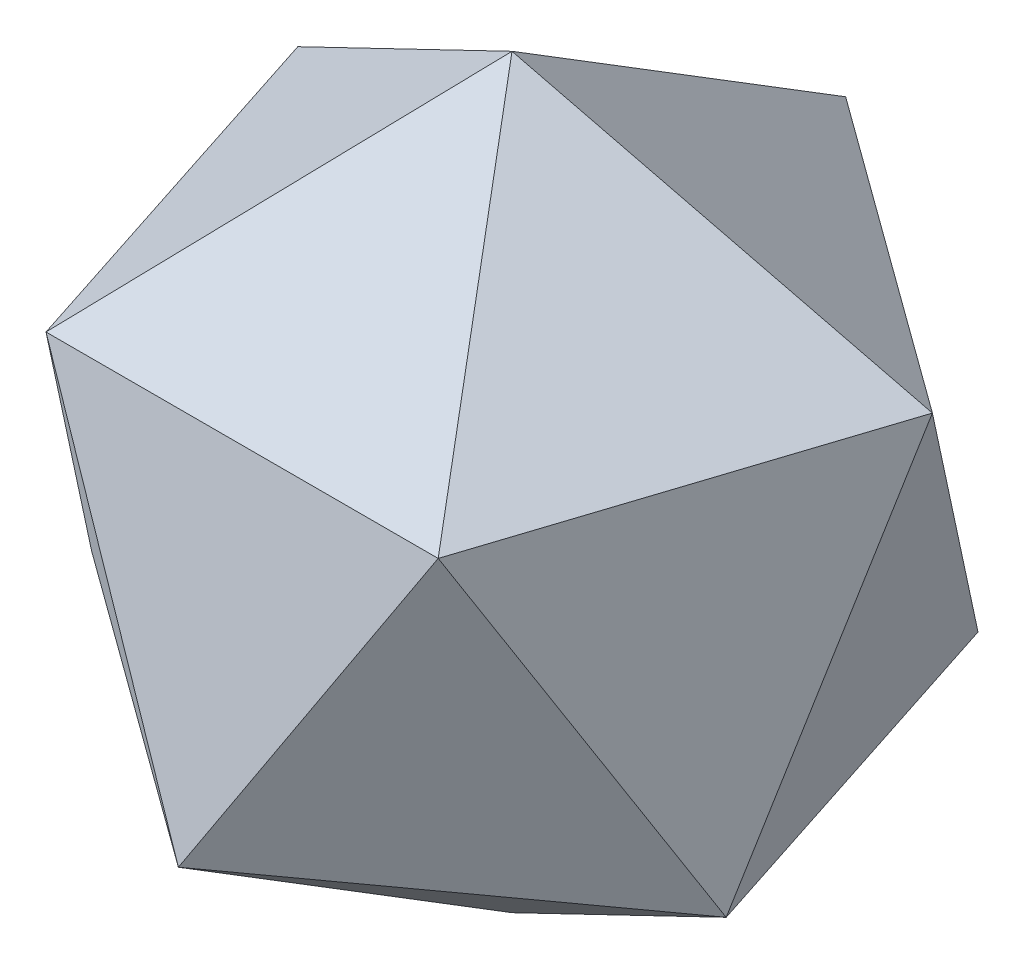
from build123d import *

# Parameters (mm, degrees)
SKETCH2_R          = 95.10565163
CUT_EXTRUDE1_DEPTH = 236.089119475
SKETCH3_R          = 95.10565163
CUT_EXTRUDE2_DEPTH = 223.854114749
SKETCH4_R          = 95.10565163
CUT_EXTRUDE3_DEPTH = 236.089119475
SKETCH5_R          = 95.10565163
CUT_EXTRUDE4_DEPTH = 238.613332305
CIRPATTERN1_COUNT  = 5


with BuildPart() as part:
    # Sketch1 → Revolve1 (revolve)
    with BuildSketch(Plane.XY):
        with BuildLine():
            Line((0, -95.10565163), (0, 95.10565163))
            ThreePointArc((0, 95.10565163), (95.10565163, 0), (0, -95.10565163))
        make_face()
    revolve(axis=Axis((0, -95.10565163, 0), (0, 1, 0)))

    # Sketch2 → Cut-Extrude1 (cut, through all)
    with BuildSketch(Plane(origin=(-43.633899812, -14.177513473, 60.056910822), x_dir=(-0.8164965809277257, 0.13264791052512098, -0.561905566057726), z_dir=(0.5773502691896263, 0.1875924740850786, -0.7946544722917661))):
        Circle(SKETCH2_R)
    cut_extrude1 = extrude(amount=-CUT_EXTRUDE1_DEPTH, mode=Mode.SUBTRACT)

    # Sketch3 → Cut-Extrude2 (cut, through all)
    with BuildSketch(Plane(origin=(0, 14.177513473, 74.234424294), x_dir=(-1, 0, 0), z_dir=(0, -0.18759247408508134, -0.9822469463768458))):
        Circle(SKETCH3_R)
    cut_extrude2 = extrude(amount=-CUT_EXTRUDE2_DEPTH, mode=Mode.SUBTRACT)

    # Sketch4 → Cut-Extrude3 (cut, through all)
    with BuildSketch(Plane(origin=(-43.633899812, 60.056910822, 14.177513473), x_dir=(-0.8164965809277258, -0.5619055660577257, -0.13264791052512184), z_dir=(-0.5773502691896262, 0.7946544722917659, 0.1875924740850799))):
        Circle(SKETCH4_R)
    cut_extrude3 = extrude(amount=CUT_EXTRUDE3_DEPTH, mode=Mode.SUBTRACT)

    # Sketch5 → Cut-Extrude4 (cut, through all)
    with BuildSketch(Plane(origin=(-26.967233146, -60.056910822, 37.117212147), x_dir=(0.934172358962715, -0.3035309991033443, 0.18759247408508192), z_dir=(-0.356822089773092, -0.794654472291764, 0.491123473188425))):
        Circle(SKETCH5_R)
    cut_extrude4 = extrude(amount=CUT_EXTRUDE4_DEPTH, mode=Mode.SUBTRACT)

    # CirPattern1: Cut-Extrude1, Cut-Extrude2, Cut-Extrude3, Cut-Extrude4 ×5 about axis
    cirpattern1_axis = Axis((0, 0, 0), (0, 1, 0))
    add([cut_extrude1.rotate(cirpattern1_axis, i * 360 / CIRPATTERN1_COUNT) for i in range(1, CIRPATTERN1_COUNT)], mode=Mode.SUBTRACT)
    add([cut_extrude2.rotate(cirpattern1_axis, i * 360 / CIRPATTERN1_COUNT) for i in range(1, CIRPATTERN1_COUNT)], mode=Mode.SUBTRACT)
    add([cut_extrude3.rotate(cirpattern1_axis, i * 360 / CIRPATTERN1_COUNT) for i in range(1, CIRPATTERN1_COUNT)], mode=Mode.SUBTRACT)
    add([cut_extrude4.rotate(cirpattern1_axis, i * 360 / CIRPATTERN1_COUNT) for i in range(1, CIRPATTERN1_COUNT)], mode=Mode.SUBTRACT)


solid = part.part
